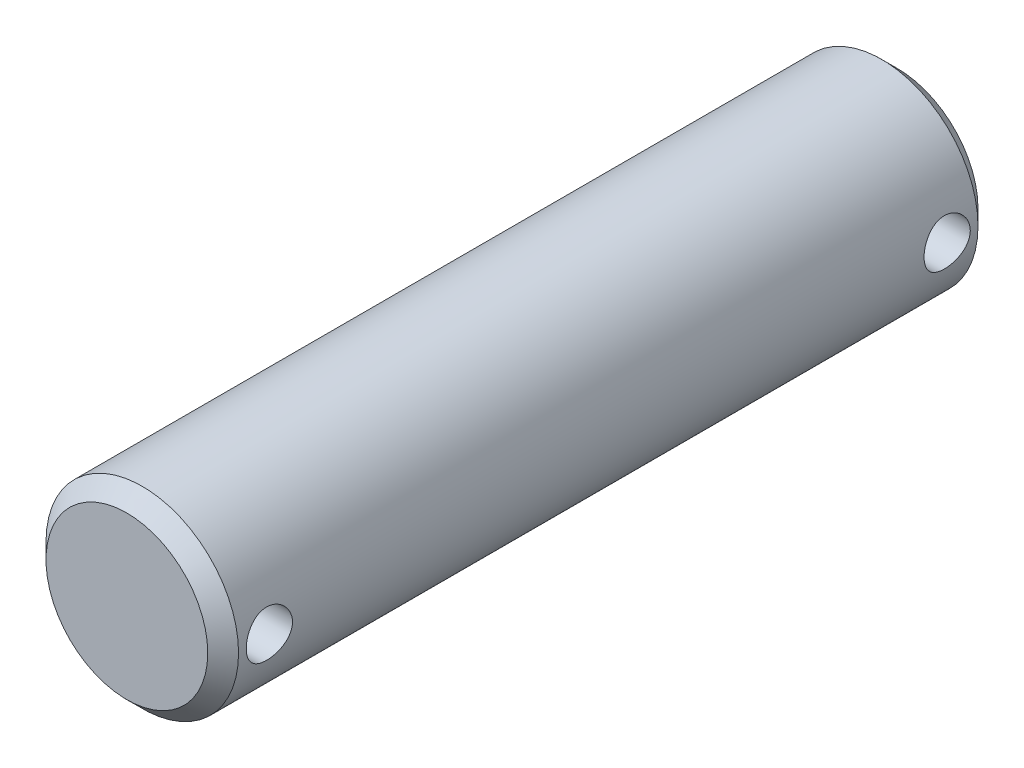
ISO-10303-21;
HEADER;
FILE_DESCRIPTION(('STEP AP214'),'2;1');
FILE_NAME('part.step','',(''),(''),'','','');
FILE_SCHEMA(('AUTOMOTIVE_DESIGN { 1 0 10303 214 1 1 1 1 }'));
ENDSEC;
DATA;
#1=APPLICATION_CONTEXT('core data for automotive mechanical design processes');
#2=APPLICATION_PROTOCOL_DEFINITION('international standard','automotive_design',2000,#1);
#3=PRODUCT_CONTEXT('',#1,'mechanical');
#4=PRODUCT('Part','Part','',(#3));
#5=PRODUCT_RELATED_PRODUCT_CATEGORY('part','',(#4));
#6=PRODUCT_DEFINITION_FORMATION('','',#4);
#7=PRODUCT_DEFINITION_CONTEXT('part definition',#1,'design');
#8=PRODUCT_DEFINITION('design','',#6,#7);
#9=PRODUCT_DEFINITION_SHAPE('','',#8);
#10=(LENGTH_UNIT() NAMED_UNIT(*) SI_UNIT(.MILLI.,.METRE.));
#11=(NAMED_UNIT(*) PLANE_ANGLE_UNIT() SI_UNIT($,.RADIAN.));
#12=(NAMED_UNIT(*) SI_UNIT($,.STERADIAN.) SOLID_ANGLE_UNIT());
#13=UNCERTAINTY_MEASURE_WITH_UNIT(LENGTH_MEASURE(1.E-05),#10,'distance_accuracy_value','');
#14=(GEOMETRIC_REPRESENTATION_CONTEXT(3) GLOBAL_UNCERTAINTY_ASSIGNED_CONTEXT((#13)) GLOBAL_UNIT_ASSIGNED_CONTEXT((#10,
#11,#12)) REPRESENTATION_CONTEXT('',''));
#15=CARTESIAN_POINT('',(0.,0.,0.));
#16=DIRECTION('',(0.,0.,1.));
#17=DIRECTION('',(1.,0.,0.));
#18=AXIS2_PLACEMENT_3D('',#15,#16,#17);
#19=CARTESIAN_POINT('',(0.,0.,100.));
#20=DIRECTION('',(0.,0.,-1.));
#21=DIRECTION('',(-1.,0.,0.));
#22=AXIS2_PLACEMENT_3D('',#19,#20,#21);
#23=CYLINDRICAL_SURFACE('',#22,12.5);
#24=CARTESIAN_POINT('',(-12.5,0.,97.));
#25=CARTESIAN_POINT('',(-12.4999970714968,-0.165963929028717,96.9999949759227));
#26=CARTESIAN_POINT('',(-12.4966615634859,-0.331985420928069,96.9861815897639));
#27=CARTESIAN_POINT('',(-12.4836783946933,-0.659284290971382,96.9313672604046));
#28=CARTESIAN_POINT('',(-12.4740268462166,-0.820558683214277,96.8903495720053));
#29=CARTESIAN_POINT('',(-12.4494823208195,-1.13358839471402,96.7825076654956));
#30=CARTESIAN_POINT('',(-12.4345953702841,-1.28535442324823,96.7157131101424));
#31=CARTESIAN_POINT('',(-12.4011725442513,-1.57552517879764,96.5583145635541));
#32=CARTESIAN_POINT('',(-12.3826366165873,-1.71392971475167,96.4677102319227));
#33=CARTESIAN_POINT('',(-12.3435386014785,-1.97609263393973,96.2634358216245));
#34=CARTESIAN_POINT('',(-12.3229472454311,-2.09955952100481,96.1493972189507));
#35=CARTESIAN_POINT('',(-12.2822574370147,-2.32581080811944,95.9022811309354));
#36=CARTESIAN_POINT('',(-12.2621590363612,-2.4285930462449,95.7692016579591));
#37=CARTESIAN_POINT('',(-12.224437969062,-2.61189993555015,95.4855541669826));
#38=CARTESIAN_POINT('',(-12.2068525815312,-2.69210377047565,95.3347734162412));
#39=CARTESIAN_POINT('',(-12.1765733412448,-2.82591582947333,95.0213801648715));
#40=CARTESIAN_POINT('',(-12.1638787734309,-2.87952794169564,94.8587693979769));
#41=CARTESIAN_POINT('',(-12.1451184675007,-2.95765058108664,94.5295234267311));
#42=CARTESIAN_POINT('',(-12.1389341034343,-2.98268262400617,94.3630188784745));
#43=CARTESIAN_POINT('',(-12.1335389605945,-3.00455808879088,94.0280676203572));
#44=CARTESIAN_POINT('',(-12.1343271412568,-3.001405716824,93.8596212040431));
#45=CARTESIAN_POINT('',(-12.1426811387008,-2.96741912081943,93.5295240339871));
#46=CARTESIAN_POINT('',(-12.1500960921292,-2.93720103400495,93.3678054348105));
#47=CARTESIAN_POINT('',(-12.1706283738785,-2.8509214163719,93.0518026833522));
#48=CARTESIAN_POINT('',(-12.1837460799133,-2.79485817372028,92.8975190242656));
#49=CARTESIAN_POINT('',(-12.2143476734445,-2.65794121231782,92.5990870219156));
#50=CARTESIAN_POINT('',(-12.2318714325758,-2.5768594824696,92.4550475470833));
#51=CARTESIAN_POINT('',(-12.2692875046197,-2.39236688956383,92.1823954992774));
#52=CARTESIAN_POINT('',(-12.2891802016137,-2.28895240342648,92.0537854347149));
#53=CARTESIAN_POINT('',(-12.329732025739,-2.05951493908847,91.8121064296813));
#54=CARTESIAN_POINT('',(-12.3503975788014,-1.93297064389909,91.6995329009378));
#55=CARTESIAN_POINT('',(-12.3896951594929,-1.66255592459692,91.4971152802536));
#56=CARTESIAN_POINT('',(-12.4083271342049,-1.51868504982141,91.4072717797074));
#57=CARTESIAN_POINT('',(-12.4415394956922,-1.21702847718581,91.2527027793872));
#58=CARTESIAN_POINT('',(-12.4561077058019,-1.05920278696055,91.1880525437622));
#59=CARTESIAN_POINT('',(-12.4794620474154,-0.73449760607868,91.0863349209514));
#60=CARTESIAN_POINT('',(-12.4882491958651,-0.567619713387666,91.0492626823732));
#61=CARTESIAN_POINT('',(-12.4989027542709,-0.233787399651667,91.004497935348));
#62=CARTESIAN_POINT('',(-12.5009282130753,-0.0669284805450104,90.9961301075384));
#63=CARTESIAN_POINT('',(-12.4982807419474,0.265804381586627,91.0071667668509));
#64=CARTESIAN_POINT('',(-12.4936083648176,0.43167840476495,91.0265689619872));
#65=CARTESIAN_POINT('',(-12.4781916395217,0.755422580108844,91.0920369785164));
#66=CARTESIAN_POINT('',(-12.4675301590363,0.913370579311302,91.1377391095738));
#67=CARTESIAN_POINT('',(-12.4413335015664,1.21935330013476,91.2540981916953));
#68=CARTESIAN_POINT('',(-12.4257978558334,1.3673870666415,91.3247575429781));
#69=CARTESIAN_POINT('',(-12.3911910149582,1.6520615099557,91.4903665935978));
#70=CARTESIAN_POINT('',(-12.3720653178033,1.78847176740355,91.5857007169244));
#71=CARTESIAN_POINT('',(-12.3324936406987,2.04359904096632,91.7974569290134));
#72=CARTESIAN_POINT('',(-12.3120474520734,2.16231325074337,91.9138823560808));
#73=CARTESIAN_POINT('',(-12.2715742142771,2.38142453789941,92.1676408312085));
#74=CARTESIAN_POINT('',(-12.2515669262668,2.4813497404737,92.3053851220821));
#75=CARTESIAN_POINT('',(-12.2147538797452,2.65666020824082,92.5960904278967));
#76=CARTESIAN_POINT('',(-12.1979479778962,2.7320465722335,92.7490507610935));
#77=CARTESIAN_POINT('',(-12.1696189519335,2.85558993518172,93.065012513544));
#78=CARTESIAN_POINT('',(-12.1580647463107,2.90390754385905,93.2279482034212));
#79=CARTESIAN_POINT('',(-12.1415072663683,2.97238380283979,93.5599461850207));
#80=CARTESIAN_POINT('',(-12.1365026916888,2.99254804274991,93.7290072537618));
#81=CARTESIAN_POINT('',(-12.1337046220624,3.00387066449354,94.0636707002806));
#82=CARTESIAN_POINT('',(-12.1357241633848,2.99578106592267,94.2292464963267));
#83=CARTESIAN_POINT('',(-12.1463176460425,2.95253345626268,94.5565997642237));
#84=CARTESIAN_POINT('',(-12.1548914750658,2.91737590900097,94.7183773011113));
#85=CARTESIAN_POINT('',(-12.1775274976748,2.82138591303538,95.0327975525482));
#86=CARTESIAN_POINT('',(-12.191561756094,2.76068402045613,95.1854822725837));
#87=CARTESIAN_POINT('',(-12.2235433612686,2.61543373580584,95.4786044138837));
#88=CARTESIAN_POINT('',(-12.2414912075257,2.53088229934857,95.6190402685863));
#89=CARTESIAN_POINT('',(-12.279819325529,2.33793007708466,95.8873370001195));
#90=CARTESIAN_POINT('',(-12.3002478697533,2.2290026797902,96.0148123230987));
#91=CARTESIAN_POINT('',(-12.3409359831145,1.99143074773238,96.2499199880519));
#92=CARTESIAN_POINT('',(-12.361195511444,1.86278158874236,96.3575476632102));
#93=CARTESIAN_POINT('',(-12.3996570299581,1.58688299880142,96.5516092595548));
#94=CARTESIAN_POINT('',(-12.4178200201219,1.43936414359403,96.637668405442));
#95=CARTESIAN_POINT('',(-12.4496380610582,1.13153622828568,96.7836295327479));
#96=CARTESIAN_POINT('',(-12.4632965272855,0.97123697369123,96.8435513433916));
#97=CARTESIAN_POINT('',(-12.4824059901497,0.675887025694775,96.9260386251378));
#98=CARTESIAN_POINT('',(-12.4889599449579,0.542312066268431,96.9537166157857));
#99=CARTESIAN_POINT('',(-12.4977580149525,0.272504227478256,96.9906987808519));
#100=CARTESIAN_POINT('',(-12.5000024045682,0.13627151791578,97.0000041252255));
#101=CARTESIAN_POINT('',(-12.5,0.,97.));
#102=B_SPLINE_CURVE_WITH_KNOTS('',3,(#24,#25,#26,#27,#28,#29,#30,#31,#32,#33,#34,#35,#36,#37,
#38,#39,#40,#41,#42,#43,#44,#45,#46,#47,#48,#49,#50,#51,#52,#53,#54,#55,#56,#57,#58,#59,#60,#61,
#62,#63,#64,#65,#66,#67,#68,#69,#70,#71,#72,#73,#74,#75,#76,#77,#78,#79,#80,#81,#82,#83,#84,#85,
#86,#87,#88,#89,#90,#91,#92,#93,#94,#95,#96,#97,#98,#99,#100,#101),.UNSPECIFIED.,.T.,.F.,(4,2,2,
2,2,2,2,2,2,2,2,2,2,2,2,2,2,2,2,2,2,2,2,2,2,2,2,2,2,2,2,2,2,2,2,2,2,2,4),(0.,0.497392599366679,
0.995091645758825,1.49221966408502,1.9893547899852,2.49500570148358,3.00070943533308,
3.51327262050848,4.02576083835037,4.52873995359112,5.03164400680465,5.52338274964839,
6.0151540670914,6.51154667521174,7.00801987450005,7.51749958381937,8.02699254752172,
8.53799614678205,9.04890983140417,9.54771776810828,10.0464845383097,10.5385143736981,
11.0305915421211,11.5308523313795,12.0311923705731,12.5427824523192,13.0543496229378,
13.5628484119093,14.0712462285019,14.5662165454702,15.06117838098,15.5536406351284,
16.0461657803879,16.5505844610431,17.055121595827,17.5678974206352,18.0802835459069,
18.4887142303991,18.8971189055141),.UNSPECIFIED.);
#103=CARTESIAN_POINT('',(-12.5,0.,97.));
#104=VERTEX_POINT('',#103);
#105=EDGE_CURVE('E35',#104,#104,#102,.T.);
#106=ORIENTED_EDGE('',*,*,#105,.T.);
#107=EDGE_LOOP('',(#106));
#108=FACE_BOUND('',#107,.T.);
#109=CARTESIAN_POINT('',(12.5,0.,91.));
#110=CARTESIAN_POINT('',(12.4999970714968,-0.165963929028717,91.0000050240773));
#111=CARTESIAN_POINT('',(12.4966615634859,-0.331985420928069,91.0138184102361));
#112=CARTESIAN_POINT('',(12.4836783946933,-0.659284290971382,91.0686327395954));
#113=CARTESIAN_POINT('',(12.4740268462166,-0.820558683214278,91.1096504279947));
#114=CARTESIAN_POINT('',(12.4494823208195,-1.13358839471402,91.2174923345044));
#115=CARTESIAN_POINT('',(12.4345953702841,-1.28535442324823,91.2842868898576));
#116=CARTESIAN_POINT('',(12.4011725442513,-1.57552517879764,91.4416854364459));
#117=CARTESIAN_POINT('',(12.3826366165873,-1.71392971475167,91.5322897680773));
#118=CARTESIAN_POINT('',(12.3435386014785,-1.97609263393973,91.7365641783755));
#119=CARTESIAN_POINT('',(12.3229472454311,-2.09955952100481,91.8506027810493));
#120=CARTESIAN_POINT('',(12.2822574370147,-2.32581080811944,92.0977188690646));
#121=CARTESIAN_POINT('',(12.2621590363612,-2.4285930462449,92.2307983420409));
#122=CARTESIAN_POINT('',(12.224437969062,-2.61189993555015,92.5144458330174));
#123=CARTESIAN_POINT('',(12.2068525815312,-2.69210377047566,92.6652265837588));
#124=CARTESIAN_POINT('',(12.1765733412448,-2.82591582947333,92.9786198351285));
#125=CARTESIAN_POINT('',(12.1638787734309,-2.87952794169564,93.1412306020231));
#126=CARTESIAN_POINT('',(12.1451184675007,-2.95765058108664,93.4704765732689));
#127=CARTESIAN_POINT('',(12.1389341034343,-2.98268262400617,93.6369811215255));
#128=CARTESIAN_POINT('',(12.1335389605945,-3.00455808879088,93.9719323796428));
#129=CARTESIAN_POINT('',(12.1343271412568,-3.001405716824,94.1403787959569));
#130=CARTESIAN_POINT('',(12.1426811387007,-2.96741912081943,94.4704759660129));
#131=CARTESIAN_POINT('',(12.1500960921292,-2.93720103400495,94.6321945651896));
#132=CARTESIAN_POINT('',(12.1706283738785,-2.85092141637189,94.9481973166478));
#133=CARTESIAN_POINT('',(12.1837460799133,-2.79485817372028,95.1024809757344));
#134=CARTESIAN_POINT('',(12.2143476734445,-2.65794121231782,95.4009129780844));
#135=CARTESIAN_POINT('',(12.2318714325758,-2.5768594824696,95.5449524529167));
#136=CARTESIAN_POINT('',(12.2692875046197,-2.39236688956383,95.8176045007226));
#137=CARTESIAN_POINT('',(12.2891802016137,-2.28895240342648,95.9462145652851));
#138=CARTESIAN_POINT('',(12.329732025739,-2.05951493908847,96.1878935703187));
#139=CARTESIAN_POINT('',(12.3503975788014,-1.93297064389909,96.3004670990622));
#140=CARTESIAN_POINT('',(12.3896951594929,-1.66255592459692,96.5028847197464));
#141=CARTESIAN_POINT('',(12.4083271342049,-1.51868504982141,96.5927282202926));
#142=CARTESIAN_POINT('',(12.4415394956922,-1.21702847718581,96.7472972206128));
#143=CARTESIAN_POINT('',(12.4561077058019,-1.05920278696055,96.8119474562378));
#144=CARTESIAN_POINT('',(12.4794620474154,-0.734497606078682,96.9136650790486));
#145=CARTESIAN_POINT('',(12.4882491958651,-0.567619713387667,96.9507373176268));
#146=CARTESIAN_POINT('',(12.4989027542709,-0.233787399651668,96.995502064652));
#147=CARTESIAN_POINT('',(12.5009282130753,-0.0669284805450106,97.0038698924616));
#148=CARTESIAN_POINT('',(12.4982807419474,0.265804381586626,96.9928332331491));
#149=CARTESIAN_POINT('',(12.4936083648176,0.43167840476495,96.9734310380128));
#150=CARTESIAN_POINT('',(12.4781916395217,0.755422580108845,96.9079630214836));
#151=CARTESIAN_POINT('',(12.4675301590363,0.913370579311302,96.8622608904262));
#152=CARTESIAN_POINT('',(12.4413335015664,1.21935330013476,96.7459018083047));
#153=CARTESIAN_POINT('',(12.4257978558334,1.3673870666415,96.6752424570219));
#154=CARTESIAN_POINT('',(12.3911910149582,1.6520615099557,96.5096334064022));
#155=CARTESIAN_POINT('',(12.3720653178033,1.78847176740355,96.4142992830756));
#156=CARTESIAN_POINT('',(12.3324936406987,2.04359904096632,96.2025430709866));
#157=CARTESIAN_POINT('',(12.3120474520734,2.16231325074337,96.0861176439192));
#158=CARTESIAN_POINT('',(12.2715742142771,2.38142453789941,95.8323591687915));
#159=CARTESIAN_POINT('',(12.2515669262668,2.48134974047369,95.6946148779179));
#160=CARTESIAN_POINT('',(12.2147538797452,2.65666020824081,95.4039095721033));
#161=CARTESIAN_POINT('',(12.1979479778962,2.7320465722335,95.2509492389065));
#162=CARTESIAN_POINT('',(12.1696189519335,2.85558993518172,94.934987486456));
#163=CARTESIAN_POINT('',(12.1580647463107,2.90390754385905,94.7720517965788));
#164=CARTESIAN_POINT('',(12.1415072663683,2.97238380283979,94.4400538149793));
#165=CARTESIAN_POINT('',(12.1365026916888,2.99254804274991,94.2709927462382));
#166=CARTESIAN_POINT('',(12.1337046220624,3.00387066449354,93.9363292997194));
#167=CARTESIAN_POINT('',(12.1357241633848,2.99578106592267,93.7707535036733));
#168=CARTESIAN_POINT('',(12.1463176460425,2.95253345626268,93.4434002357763));
#169=CARTESIAN_POINT('',(12.1548914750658,2.91737590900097,93.2816226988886));
#170=CARTESIAN_POINT('',(12.1775274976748,2.82138591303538,92.9672024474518));
#171=CARTESIAN_POINT('',(12.191561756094,2.76068402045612,92.8145177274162));
#172=CARTESIAN_POINT('',(12.2235433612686,2.61543373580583,92.5213955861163));
#173=CARTESIAN_POINT('',(12.2414912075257,2.53088229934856,92.3809597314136));
#174=CARTESIAN_POINT('',(12.279819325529,2.33793007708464,92.1126629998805));
#175=CARTESIAN_POINT('',(12.3002478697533,2.22900267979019,91.9851876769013));
#176=CARTESIAN_POINT('',(12.3409359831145,1.99143074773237,91.7500800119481));
#177=CARTESIAN_POINT('',(12.361195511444,1.86278158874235,91.6424523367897));
#178=CARTESIAN_POINT('',(12.3996570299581,1.58688299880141,91.4483907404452));
#179=CARTESIAN_POINT('',(12.4178200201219,1.43936414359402,91.362331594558));
#180=CARTESIAN_POINT('',(12.4496380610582,1.13153622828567,91.2163704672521));
#181=CARTESIAN_POINT('',(12.4632965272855,0.971236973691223,91.1564486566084));
#182=CARTESIAN_POINT('',(12.4824059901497,0.675887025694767,91.0739613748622));
#183=CARTESIAN_POINT('',(12.4889599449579,0.542312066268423,91.0462833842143));
#184=CARTESIAN_POINT('',(12.4977580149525,0.272504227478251,91.0093012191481));
#185=CARTESIAN_POINT('',(12.5000024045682,0.136271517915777,90.9999958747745));
#186=CARTESIAN_POINT('',(12.5,0.,91.));
#187=B_SPLINE_CURVE_WITH_KNOTS('',3,(#109,#110,#111,#112,#113,#114,#115,#116,#117,#118,#119,
#120,#121,#122,#123,#124,#125,#126,#127,#128,#129,#130,#131,#132,#133,#134,#135,#136,#137,#138,
#139,#140,#141,#142,#143,#144,#145,#146,#147,#148,#149,#150,#151,#152,#153,#154,#155,#156,#157,
#158,#159,#160,#161,#162,#163,#164,#165,#166,#167,#168,#169,#170,#171,#172,#173,#174,#175,#176,
#177,#178,#179,#180,#181,#182,#183,#184,#185,#186),.UNSPECIFIED.,.T.,.F.,(4,2,2,2,2,2,2,2,2,2,2,
2,2,2,2,2,2,2,2,2,2,2,2,2,2,2,2,2,2,2,2,2,2,2,2,2,2,2,4),(0.,0.497392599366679,
0.995091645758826,1.49221966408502,1.9893547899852,2.49500570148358,3.00070943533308,
3.51327262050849,4.02576083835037,4.52873995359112,5.03164400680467,5.5233827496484,
6.0151540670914,6.51154667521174,7.00801987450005,7.51749958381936,8.02699254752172,
8.53799614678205,9.04890983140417,9.54771776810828,10.0464845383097,10.5385143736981,
11.0305915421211,11.5308523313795,12.0311923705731,12.5427824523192,13.0543496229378,
13.5628484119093,14.0712462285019,14.5662165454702,15.06117838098,15.5536406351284,
16.0461657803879,16.5505844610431,17.055121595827,17.5678974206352,18.0802835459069,
18.4887142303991,18.8971189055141),.UNSPECIFIED.);
#188=CARTESIAN_POINT('',(12.5,0.,91.));
#189=VERTEX_POINT('',#188);
#190=EDGE_CURVE('E93',#189,#189,#187,.T.);
#191=ORIENTED_EDGE('',*,*,#190,.T.);
#192=EDGE_LOOP('',(#191));
#193=FACE_BOUND('',#192,.T.);
#194=CARTESIAN_POINT('',(-12.5,0.,8.99999999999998));
#195=CARTESIAN_POINT('',(-12.4999970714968,-0.165963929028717,8.99999497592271));
#196=CARTESIAN_POINT('',(-12.4966615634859,-0.33198542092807,8.98618158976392));
#197=CARTESIAN_POINT('',(-12.4836783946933,-0.659284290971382,8.93136726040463));
#198=CARTESIAN_POINT('',(-12.4740268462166,-0.820558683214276,8.89034957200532));
#199=CARTESIAN_POINT('',(-12.4494823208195,-1.13358839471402,8.78250766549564));
#200=CARTESIAN_POINT('',(-12.4345953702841,-1.28535442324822,8.71571311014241));
#201=CARTESIAN_POINT('',(-12.4011725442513,-1.57552517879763,8.55831456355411));
#202=CARTESIAN_POINT('',(-12.3826366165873,-1.71392971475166,8.46771023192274));
#203=CARTESIAN_POINT('',(-12.3435386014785,-1.97609263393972,8.26343582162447));
#204=CARTESIAN_POINT('',(-12.3229472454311,-2.0995595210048,8.14939721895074));
#205=CARTESIAN_POINT('',(-12.2822574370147,-2.32581080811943,7.90228113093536));
#206=CARTESIAN_POINT('',(-12.2621590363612,-2.42859304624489,7.76920165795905));
#207=CARTESIAN_POINT('',(-12.224437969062,-2.61189993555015,7.48555416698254));
#208=CARTESIAN_POINT('',(-12.2068525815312,-2.69210377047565,7.33477341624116));
#209=CARTESIAN_POINT('',(-12.1765733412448,-2.82591582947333,7.02138016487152));
#210=CARTESIAN_POINT('',(-12.1638787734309,-2.87952794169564,6.85876939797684));
#211=CARTESIAN_POINT('',(-12.1451184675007,-2.95765058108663,6.5295234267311));
#212=CARTESIAN_POINT('',(-12.1389341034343,-2.98268262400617,6.36301887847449));
#213=CARTESIAN_POINT('',(-12.1335389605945,-3.00455808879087,6.02806762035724));
#214=CARTESIAN_POINT('',(-12.1343271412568,-3.00140571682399,5.85962120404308));
#215=CARTESIAN_POINT('',(-12.1426811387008,-2.96741912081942,5.52952403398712));
#216=CARTESIAN_POINT('',(-12.1500960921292,-2.93720103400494,5.36780543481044));
#217=CARTESIAN_POINT('',(-12.1706283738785,-2.85092141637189,5.05180268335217));
#218=CARTESIAN_POINT('',(-12.1837460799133,-2.79485817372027,4.89751902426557));
#219=CARTESIAN_POINT('',(-12.2143476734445,-2.65794121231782,4.59908702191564));
#220=CARTESIAN_POINT('',(-12.2318714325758,-2.5768594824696,4.45504754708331));
#221=CARTESIAN_POINT('',(-12.2692875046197,-2.39236688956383,4.18239549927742));
#222=CARTESIAN_POINT('',(-12.2891802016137,-2.28895240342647,4.05378543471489));
#223=CARTESIAN_POINT('',(-12.329732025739,-2.05951493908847,3.81210642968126));
#224=CARTESIAN_POINT('',(-12.3503975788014,-1.93297064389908,3.69953290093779));
#225=CARTESIAN_POINT('',(-12.3896951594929,-1.66255592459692,3.49711528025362));
#226=CARTESIAN_POINT('',(-12.4083271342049,-1.51868504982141,3.40727177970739));
#227=CARTESIAN_POINT('',(-12.4415394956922,-1.21702847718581,3.25270277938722));
#228=CARTESIAN_POINT('',(-12.4561077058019,-1.05920278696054,3.18805254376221));
#229=CARTESIAN_POINT('',(-12.4794620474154,-0.734497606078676,3.08633492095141));
#230=CARTESIAN_POINT('',(-12.4882491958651,-0.567619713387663,3.04926268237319));
#231=CARTESIAN_POINT('',(-12.4989027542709,-0.233787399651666,3.00449793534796));
#232=CARTESIAN_POINT('',(-12.5009282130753,-0.0669284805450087,2.99613010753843));
#233=CARTESIAN_POINT('',(-12.4982807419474,0.265804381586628,3.0071667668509));
#234=CARTESIAN_POINT('',(-12.4936083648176,0.431678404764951,3.02656896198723));
#235=CARTESIAN_POINT('',(-12.4781916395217,0.755422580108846,3.09203697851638));
#236=CARTESIAN_POINT('',(-12.4675301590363,0.913370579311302,3.1377391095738));
#237=CARTESIAN_POINT('',(-12.4413335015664,1.21935330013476,3.25409819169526));
#238=CARTESIAN_POINT('',(-12.4257978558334,1.3673870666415,3.3247575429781));
#239=CARTESIAN_POINT('',(-12.3911910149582,1.6520615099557,3.49036659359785));
#240=CARTESIAN_POINT('',(-12.3720653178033,1.78847176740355,3.58570071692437));
#241=CARTESIAN_POINT('',(-12.3324936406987,2.04359904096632,3.79745692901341));
#242=CARTESIAN_POINT('',(-12.3120474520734,2.16231325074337,3.91388235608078));
#243=CARTESIAN_POINT('',(-12.2715742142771,2.38142453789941,4.16764083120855));
#244=CARTESIAN_POINT('',(-12.2515669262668,2.4813497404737,4.3053851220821));
#245=CARTESIAN_POINT('',(-12.2147538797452,2.65666020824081,4.59609042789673));
#246=CARTESIAN_POINT('',(-12.1979479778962,2.7320465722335,4.74905076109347));
#247=CARTESIAN_POINT('',(-12.1696189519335,2.85558993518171,5.06501251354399));
#248=CARTESIAN_POINT('',(-12.1580647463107,2.90390754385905,5.22794820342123));
#249=CARTESIAN_POINT('',(-12.1415072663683,2.97238380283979,5.55994618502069));
#250=CARTESIAN_POINT('',(-12.1365026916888,2.99254804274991,5.72900725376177));
#251=CARTESIAN_POINT('',(-12.1337046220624,3.00387066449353,6.0636707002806));
#252=CARTESIAN_POINT('',(-12.1357241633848,2.99578106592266,6.22924649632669));
#253=CARTESIAN_POINT('',(-12.1463176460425,2.95253345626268,6.55659976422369));
#254=CARTESIAN_POINT('',(-12.1548914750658,2.91737590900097,6.71837730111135));
#255=CARTESIAN_POINT('',(-12.1775274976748,2.82138591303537,7.03279755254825));
#256=CARTESIAN_POINT('',(-12.191561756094,2.76068402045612,7.18548227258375));
#257=CARTESIAN_POINT('',(-12.2235433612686,2.61543373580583,7.47860441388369));
#258=CARTESIAN_POINT('',(-12.2414912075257,2.53088229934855,7.61904026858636));
#259=CARTESIAN_POINT('',(-12.279819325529,2.33793007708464,7.88733700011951));
#260=CARTESIAN_POINT('',(-12.3002478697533,2.22900267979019,8.01481232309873));
#261=CARTESIAN_POINT('',(-12.3409359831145,1.99143074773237,8.24991998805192));
#262=CARTESIAN_POINT('',(-12.361195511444,1.86278158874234,8.35754766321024));
#263=CARTESIAN_POINT('',(-12.3996570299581,1.5868829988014,8.55160925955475));
#264=CARTESIAN_POINT('',(-12.4178200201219,1.43936414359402,8.637668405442));
#265=CARTESIAN_POINT('',(-12.4496380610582,1.13153622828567,8.78362953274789));
#266=CARTESIAN_POINT('',(-12.4632965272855,0.971236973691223,8.84355134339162));
#267=CARTESIAN_POINT('',(-12.4824059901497,0.67588702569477,8.92603862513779));
#268=CARTESIAN_POINT('',(-12.4889599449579,0.542312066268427,8.95371661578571));
#269=CARTESIAN_POINT('',(-12.4977580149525,0.272504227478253,8.99069878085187));
#270=CARTESIAN_POINT('',(-12.5000024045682,0.136271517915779,9.0000041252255));
#271=CARTESIAN_POINT('',(-12.5,0.,8.99999999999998));
#272=B_SPLINE_CURVE_WITH_KNOTS('',3,(#194,#195,#196,#197,#198,#199,#200,#201,#202,#203,#204,
#205,#206,#207,#208,#209,#210,#211,#212,#213,#214,#215,#216,#217,#218,#219,#220,#221,#222,#223,
#224,#225,#226,#227,#228,#229,#230,#231,#232,#233,#234,#235,#236,#237,#238,#239,#240,#241,#242,
#243,#244,#245,#246,#247,#248,#249,#250,#251,#252,#253,#254,#255,#256,#257,#258,#259,#260,#261,
#262,#263,#264,#265,#266,#267,#268,#269,#270,#271),.UNSPECIFIED.,.T.,.F.,(4,2,2,2,2,2,2,2,2,2,2,
2,2,2,2,2,2,2,2,2,2,2,2,2,2,2,2,2,2,2,2,2,2,2,2,2,2,2,4),(0.,0.497392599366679,
0.995091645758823,1.49221966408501,1.98935478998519,2.49500570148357,3.00070943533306,
3.51327262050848,4.02576083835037,4.52873995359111,5.03164400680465,5.52338274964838,
6.01515406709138,6.51154667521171,7.00801987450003,7.51749958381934,8.0269925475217,
8.53799614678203,9.04890983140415,9.54771776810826,10.0464845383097,10.5385143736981,
11.0305915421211,11.5308523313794,12.031192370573,12.5427824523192,13.0543496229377,
13.5628484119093,14.0712462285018,14.5662165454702,15.0611783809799,15.5536406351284,
16.0461657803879,16.5505844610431,17.0551215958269,17.5678974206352,18.0802835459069,
18.4887142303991,18.897118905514),.UNSPECIFIED.);
#273=CARTESIAN_POINT('',(-12.5,0.,8.99999999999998));
#274=VERTEX_POINT('',#273);
#275=EDGE_CURVE('E57',#274,#274,#272,.T.);
#276=ORIENTED_EDGE('',*,*,#275,.T.);
#277=EDGE_LOOP('',(#276));
#278=FACE_BOUND('',#277,.T.);
#279=CARTESIAN_POINT('',(12.5,0.,3.));
#280=CARTESIAN_POINT('',(12.4999970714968,-0.165963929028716,3.00000502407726));
#281=CARTESIAN_POINT('',(12.4966615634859,-0.331985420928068,3.01381841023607));
#282=CARTESIAN_POINT('',(12.4836783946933,-0.659284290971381,3.06863273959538));
#283=CARTESIAN_POINT('',(12.4740268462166,-0.820558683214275,3.10965042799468));
#284=CARTESIAN_POINT('',(12.4494823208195,-1.13358839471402,3.21749233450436));
#285=CARTESIAN_POINT('',(12.4345953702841,-1.28535442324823,3.28428688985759));
#286=CARTESIAN_POINT('',(12.4011725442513,-1.57552517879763,3.44168543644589));
#287=CARTESIAN_POINT('',(12.3826366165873,-1.71392971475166,3.53228976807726));
#288=CARTESIAN_POINT('',(12.3435386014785,-1.97609263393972,3.73656417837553));
#289=CARTESIAN_POINT('',(12.3229472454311,-2.0995595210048,3.85060278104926));
#290=CARTESIAN_POINT('',(12.2822574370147,-2.32581080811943,4.09771886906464));
#291=CARTESIAN_POINT('',(12.2621590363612,-2.42859304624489,4.23079834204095));
#292=CARTESIAN_POINT('',(12.224437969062,-2.61189993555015,4.51444583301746));
#293=CARTESIAN_POINT('',(12.2068525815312,-2.69210377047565,4.66522658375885));
#294=CARTESIAN_POINT('',(12.1765733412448,-2.82591582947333,4.97861983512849));
#295=CARTESIAN_POINT('',(12.1638787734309,-2.87952794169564,5.14123060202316));
#296=CARTESIAN_POINT('',(12.1451184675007,-2.95765058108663,5.4704765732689));
#297=CARTESIAN_POINT('',(12.1389341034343,-2.98268262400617,5.63698112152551));
#298=CARTESIAN_POINT('',(12.1335389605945,-3.00455808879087,5.97193237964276));
#299=CARTESIAN_POINT('',(12.1343271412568,-3.00140571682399,6.14037879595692));
#300=CARTESIAN_POINT('',(12.1426811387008,-2.96741912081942,6.47047596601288));
#301=CARTESIAN_POINT('',(12.1500960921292,-2.93720103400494,6.63219456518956));
#302=CARTESIAN_POINT('',(12.1706283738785,-2.85092141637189,6.94819731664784));
#303=CARTESIAN_POINT('',(12.1837460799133,-2.79485817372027,7.10248097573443));
#304=CARTESIAN_POINT('',(12.2143476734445,-2.65794121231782,7.40091297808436));
#305=CARTESIAN_POINT('',(12.2318714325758,-2.5768594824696,7.54495245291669));
#306=CARTESIAN_POINT('',(12.2692875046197,-2.39236688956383,7.81760450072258));
#307=CARTESIAN_POINT('',(12.2891802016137,-2.28895240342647,7.94621456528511));
#308=CARTESIAN_POINT('',(12.329732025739,-2.05951493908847,8.18789357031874));
#309=CARTESIAN_POINT('',(12.3503975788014,-1.93297064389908,8.30046709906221));
#310=CARTESIAN_POINT('',(12.3896951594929,-1.66255592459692,8.50288471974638));
#311=CARTESIAN_POINT('',(12.4083271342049,-1.51868504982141,8.59272822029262));
#312=CARTESIAN_POINT('',(12.4415394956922,-1.21702847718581,8.74729722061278));
#313=CARTESIAN_POINT('',(12.4561077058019,-1.05920278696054,8.81194745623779));
#314=CARTESIAN_POINT('',(12.4794620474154,-0.734497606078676,8.91366507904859));
#315=CARTESIAN_POINT('',(12.4882491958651,-0.567619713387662,8.95073731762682));
#316=CARTESIAN_POINT('',(12.4989027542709,-0.233787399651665,8.99550206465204));
#317=CARTESIAN_POINT('',(12.5009282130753,-0.0669284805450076,9.00386989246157));
#318=CARTESIAN_POINT('',(12.4982807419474,0.265804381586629,8.9928332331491));
#319=CARTESIAN_POINT('',(12.4936083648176,0.431678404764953,8.97343103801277));
#320=CARTESIAN_POINT('',(12.4781916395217,0.755422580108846,8.90796302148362));
#321=CARTESIAN_POINT('',(12.4675301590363,0.913370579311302,8.8622608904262));
#322=CARTESIAN_POINT('',(12.4413335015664,1.21935330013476,8.74590180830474));
#323=CARTESIAN_POINT('',(12.4257978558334,1.3673870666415,8.67524245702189));
#324=CARTESIAN_POINT('',(12.3911910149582,1.6520615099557,8.50963340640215));
#325=CARTESIAN_POINT('',(12.3720653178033,1.78847176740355,8.41429928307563));
#326=CARTESIAN_POINT('',(12.3324936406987,2.04359904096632,8.20254307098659));
#327=CARTESIAN_POINT('',(12.3120474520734,2.16231325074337,8.08611764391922));
#328=CARTESIAN_POINT('',(12.2715742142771,2.38142453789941,7.83235916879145));
#329=CARTESIAN_POINT('',(12.2515669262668,2.4813497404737,7.6946148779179));
#330=CARTESIAN_POINT('',(12.2147538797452,2.65666020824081,7.40390957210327));
#331=CARTESIAN_POINT('',(12.1979479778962,2.7320465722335,7.25094923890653));
#332=CARTESIAN_POINT('',(12.1696189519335,2.85558993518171,6.93498748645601));
#333=CARTESIAN_POINT('',(12.1580647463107,2.90390754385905,6.77205179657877));
#334=CARTESIAN_POINT('',(12.1415072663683,2.97238380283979,6.44005381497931));
#335=CARTESIAN_POINT('',(12.1365026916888,2.99254804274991,6.27099274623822));
#336=CARTESIAN_POINT('',(12.1337046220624,3.00387066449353,5.9363292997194));
#337=CARTESIAN_POINT('',(12.1357241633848,2.99578106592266,5.7707535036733));
#338=CARTESIAN_POINT('',(12.1463176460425,2.95253345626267,5.44340023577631));
#339=CARTESIAN_POINT('',(12.1548914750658,2.91737590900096,5.28162269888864));
#340=CARTESIAN_POINT('',(12.1775274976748,2.82138591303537,4.96720244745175));
#341=CARTESIAN_POINT('',(12.191561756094,2.76068402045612,4.81451772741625));
#342=CARTESIAN_POINT('',(12.2235433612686,2.61543373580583,4.52139558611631));
#343=CARTESIAN_POINT('',(12.2414912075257,2.53088229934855,4.38095973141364));
#344=CARTESIAN_POINT('',(12.279819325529,2.33793007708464,4.11266299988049));
#345=CARTESIAN_POINT('',(12.3002478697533,2.22900267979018,3.98518767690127));
#346=CARTESIAN_POINT('',(12.3409359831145,1.99143074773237,3.75008001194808));
#347=CARTESIAN_POINT('',(12.361195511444,1.86278158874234,3.64245233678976));
#348=CARTESIAN_POINT('',(12.3996570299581,1.5868829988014,3.44839074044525));
#349=CARTESIAN_POINT('',(12.4178200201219,1.43936414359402,3.362331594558));
#350=CARTESIAN_POINT('',(12.4496380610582,1.13153622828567,3.21637046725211));
#351=CARTESIAN_POINT('',(12.4632965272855,0.971236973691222,3.15644865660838));
#352=CARTESIAN_POINT('',(12.4824059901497,0.675887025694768,3.07396137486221));
#353=CARTESIAN_POINT('',(12.4889599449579,0.542312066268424,3.0462833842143));
#354=CARTESIAN_POINT('',(12.4977580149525,0.272504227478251,3.00930121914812));
#355=CARTESIAN_POINT('',(12.5000024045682,0.136271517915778,2.99999587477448));
#356=CARTESIAN_POINT('',(12.5,0.,3.));
#357=B_SPLINE_CURVE_WITH_KNOTS('',3,(#279,#280,#281,#282,#283,#284,#285,#286,#287,#288,#289,
#290,#291,#292,#293,#294,#295,#296,#297,#298,#299,#300,#301,#302,#303,#304,#305,#306,#307,#308,
#309,#310,#311,#312,#313,#314,#315,#316,#317,#318,#319,#320,#321,#322,#323,#324,#325,#326,#327,
#328,#329,#330,#331,#332,#333,#334,#335,#336,#337,#338,#339,#340,#341,#342,#343,#344,#345,#346,
#347,#348,#349,#350,#351,#352,#353,#354,#355,#356),.UNSPECIFIED.,.T.,.F.,(4,2,2,2,2,2,2,2,2,2,2,
2,2,2,2,2,2,2,2,2,2,2,2,2,2,2,2,2,2,2,2,2,2,2,2,2,2,2,4),(0.,0.497392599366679,
0.995091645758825,1.49221966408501,1.9893547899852,2.49500570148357,3.00070943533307,
3.51327262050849,4.02576083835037,4.52873995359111,5.03164400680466,5.52338274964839,
6.01515406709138,6.51154667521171,7.00801987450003,7.51749958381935,8.02699254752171,
8.53799614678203,9.04890983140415,9.54771776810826,10.0464845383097,10.5385143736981,
11.0305915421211,11.5308523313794,12.031192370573,12.5427824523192,13.0543496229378,
13.5628484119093,14.0712462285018,14.5662165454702,15.0611783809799,15.5536406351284,
16.0461657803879,16.5505844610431,17.0551215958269,17.5678974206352,18.0802835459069,
18.4887142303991,18.897118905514),.UNSPECIFIED.);
#358=CARTESIAN_POINT('',(12.5,0.,3.));
#359=VERTEX_POINT('',#358);
#360=EDGE_CURVE('E51',#359,#359,#357,.T.);
#361=ORIENTED_EDGE('',*,*,#360,.T.);
#362=EDGE_LOOP('',(#361));
#363=FACE_BOUND('',#362,.T.);
#364=CARTESIAN_POINT('',(0.,0.,2.));
#365=DIRECTION('',(0.,0.,1.));
#366=DIRECTION('',(1.,0.,0.));
#367=AXIS2_PLACEMENT_3D('',#364,#365,#366);
#368=CIRCLE('',#367,12.5);
#369=CARTESIAN_POINT('',(12.5,0.,2.));
#370=VERTEX_POINT('',#369);
#371=EDGE_CURVE('E47',#370,#370,#368,.T.);
#372=ORIENTED_EDGE('',*,*,#371,.T.);
#373=EDGE_LOOP('',(#372));
#374=FACE_BOUND('',#373,.T.);
#375=CARTESIAN_POINT('',(0.,0.,98.));
#376=DIRECTION('',(0.,0.,1.));
#377=DIRECTION('',(1.,0.,0.));
#378=AXIS2_PLACEMENT_3D('',#375,#376,#377);
#379=CIRCLE('',#378,12.5);
#380=CARTESIAN_POINT('',(12.5,0.,98.));
#381=VERTEX_POINT('',#380);
#382=EDGE_CURVE('E104',#381,#381,#379,.F.);
#383=ORIENTED_EDGE('',*,*,#382,.T.);
#384=EDGE_LOOP('',(#383));
#385=FACE_BOUND('',#384,.T.);
#386=ADVANCED_FACE('F31',(#108,#193,#278,#363,#374,#385),#23,.T.);
#387=CARTESIAN_POINT('',(0.,0.,100.));
#388=DIRECTION('',(0.,0.,1.));
#389=DIRECTION('',(1.,0.,0.));
#390=AXIS2_PLACEMENT_3D('',#387,#388,#389);
#391=PLANE('',#390);
#392=CARTESIAN_POINT('',(0.,0.,100.));
#393=DIRECTION('',(0.,0.,1.));
#394=DIRECTION('',(1.,0.,0.));
#395=AXIS2_PLACEMENT_3D('',#392,#393,#394);
#396=CIRCLE('',#395,10.5);
#397=CARTESIAN_POINT('',(10.5,0.,100.));
#398=VERTEX_POINT('',#397);
#399=EDGE_CURVE('E10',#398,#398,#396,.T.);
#400=ORIENTED_EDGE('',*,*,#399,.T.);
#401=EDGE_LOOP('',(#400));
#402=FACE_BOUND('',#401,.T.);
#403=ADVANCED_FACE('F78',(#402),#391,.T.);
#404=CARTESIAN_POINT('',(0.,0.,0.));
#405=DIRECTION('',(0.,0.,1.));
#406=DIRECTION('',(1.,0.,0.));
#407=AXIS2_PLACEMENT_3D('',#404,#405,#406);
#408=PLANE('',#407);
#409=CARTESIAN_POINT('',(0.,0.,0.));
#410=DIRECTION('',(0.,0.,1.));
#411=DIRECTION('',(1.,0.,0.));
#412=AXIS2_PLACEMENT_3D('',#409,#410,#411);
#413=CIRCLE('',#412,10.5);
#414=CARTESIAN_POINT('',(10.5,0.,0.));
#415=VERTEX_POINT('',#414);
#416=EDGE_CURVE('E42',#415,#415,#413,.F.);
#417=ORIENTED_EDGE('',*,*,#416,.T.);
#418=EDGE_LOOP('',(#417));
#419=FACE_BOUND('',#418,.T.);
#420=ADVANCED_FACE('F75',(#419),#408,.F.);
#421=CARTESIAN_POINT('',(0.,0.,2.));
#422=DIRECTION('',(0.,0.,1.));
#423=DIRECTION('',(1.,0.,0.));
#424=AXIS2_PLACEMENT_3D('',#421,#422,#423);
#425=CONICAL_SURFACE('',#424,12.5,0.785398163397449);
#426=ORIENTED_EDGE('',*,*,#416,.F.);
#427=EDGE_LOOP('',(#426));
#428=FACE_BOUND('',#427,.T.);
#429=ORIENTED_EDGE('',*,*,#371,.F.);
#430=EDGE_LOOP('',(#429));
#431=FACE_BOUND('',#430,.T.);
#432=ADVANCED_FACE('F71',(#428,#431),#425,.T.);
#433=CARTESIAN_POINT('',(0.,0.,100.));
#434=DIRECTION('',(0.,0.,-1.));
#435=DIRECTION('',(-1.,0.,0.));
#436=AXIS2_PLACEMENT_3D('',#433,#434,#435);
#437=CONICAL_SURFACE('',#436,10.5,0.785398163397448);
#438=ORIENTED_EDGE('',*,*,#382,.F.);
#439=EDGE_LOOP('',(#438));
#440=FACE_BOUND('',#439,.T.);
#441=ORIENTED_EDGE('',*,*,#399,.F.);
#442=EDGE_LOOP('',(#441));
#443=FACE_BOUND('',#442,.T.);
#444=ADVANCED_FACE('F65',(#440,#443),#437,.T.);
#445=CARTESIAN_POINT('',(-14.,0.,6.));
#446=DIRECTION('',(1.,0.,0.));
#447=DIRECTION('',(0.,0.,-1.));
#448=AXIS2_PLACEMENT_3D('',#445,#446,#447);
#449=CYLINDRICAL_SURFACE('',#448,3.);
#450=ORIENTED_EDGE('',*,*,#360,.F.);
#451=EDGE_LOOP('',(#450));
#452=FACE_BOUND('',#451,.T.);
#453=ORIENTED_EDGE('',*,*,#275,.F.);
#454=EDGE_LOOP('',(#453));
#455=FACE_BOUND('',#454,.T.);
#456=ADVANCED_FACE('F60',(#452,#455),#449,.F.);
#457=CARTESIAN_POINT('',(-14.,0.,94.));
#458=DIRECTION('',(1.,0.,0.));
#459=DIRECTION('',(0.,0.,-1.));
#460=AXIS2_PLACEMENT_3D('',#457,#458,#459);
#461=CYLINDRICAL_SURFACE('',#460,3.00000000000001);
#462=ORIENTED_EDGE('',*,*,#190,.F.);
#463=EDGE_LOOP('',(#462));
#464=FACE_BOUND('',#463,.T.);
#465=ORIENTED_EDGE('',*,*,#105,.F.);
#466=EDGE_LOOP('',(#465));
#467=FACE_BOUND('',#466,.T.);
#468=ADVANCED_FACE('F64',(#464,#467),#461,.F.);
#469=CLOSED_SHELL('',(#386,#403,#420,#432,#444,#456,#468));
#470=MANIFOLD_SOLID_BREP('B2',#469);
#471=ADVANCED_BREP_SHAPE_REPRESENTATION('',(#18,#470),#14);
#472=SHAPE_DEFINITION_REPRESENTATION(#9,#471);
ENDSEC;
END-ISO-10303-21;
